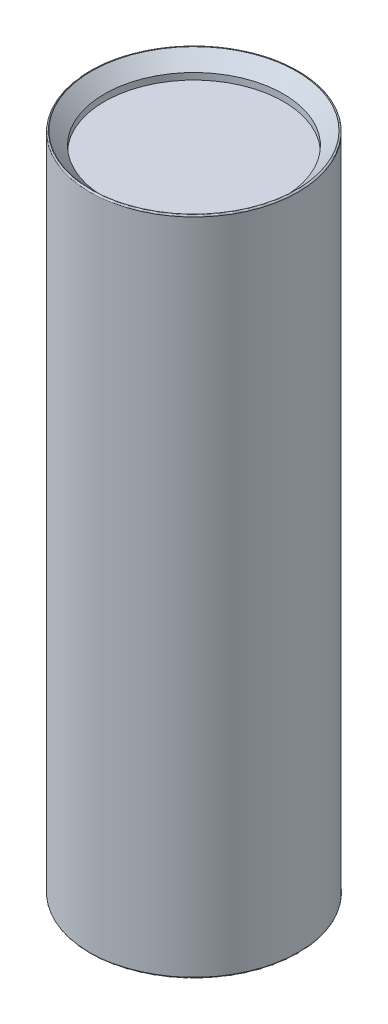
from build123d import *

# Parameters (mm, degrees)
SKETCH1_R                          = 20.193
BOSS_EXTRUDE1_DEPTH                = 128.016
SKETCH2_R                          = 17.328427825
CUT_EXTRUDE1_DEPTH                 = 3.81
CHAMFER1_SIZE                      = 2.54
FILLET1_R                          = 0.254
F_7_16_20_TAPPED_HOLE1_D           = 9.92124
F_7_16_20_TAPPED_HOLE1_DEPTH       = 26.035
F_7_16_20_TAPPED_HOLE1_CBORE_D     = 11.1125
F_7_16_20_TAPPED_HOLE1_CBORE_DEPTH = 22.225
F_7_16_20_TAPPED_HOLE1_TIP         = 2.980641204


with BuildPart() as part:
    # Sketch1 → Boss-Extrude1 (new body)
    with BuildSketch(Plane(origin=(0, 0, 0), x_dir=(1, 0, 0), z_dir=(0, 1, 0))):
        with Locations(Location((0, 0, 0), (0, 0, 270))):
            Circle(SKETCH1_R)
    extrude(amount=BOSS_EXTRUDE1_DEPTH)

    # Sketch2 → Cut-Extrude1 (cut)
    with BuildSketch(Plane(origin=(0, 128.016, 0), x_dir=(1, 0, 0), z_dir=(0, 1, 0))):
        with Locations(Location((0, 0, 0), (0, 0, 270))):
            Circle(SKETCH2_R)
    extrude(amount=-CUT_EXTRUDE1_DEPTH, mode=Mode.SUBTRACT)

    # Chamfer1
    chamfer1_edges = [part.edges().sort_by_distance(p)[0] for p in [
        (0, 128.016, -17.328427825),
    ]]
    chamfer(chamfer1_edges, length=CHAMFER1_SIZE)

    # Fillet1
    fillet1_edges = [part.edges().sort_by_distance(p)[0] for p in [
        (0, 0, -20.193),
        (0, 128.016, -20.193),
    ]]
    fillet(fillet1_edges, radius=FILLET1_R)

    # 7_16-20 Tapped Hole1
    with Locations(Plane.XZ):
        with Locations((0, 0)):
            CounterBoreHole(F_7_16_20_TAPPED_HOLE1_D / 2, F_7_16_20_TAPPED_HOLE1_CBORE_D / 2, F_7_16_20_TAPPED_HOLE1_CBORE_DEPTH, depth=F_7_16_20_TAPPED_HOLE1_DEPTH)
            with Locations((0, 0, -(F_7_16_20_TAPPED_HOLE1_DEPTH + F_7_16_20_TAPPED_HOLE1_TIP / 2))):  # 118° drill point
                Cone(0, F_7_16_20_TAPPED_HOLE1_D / 2, F_7_16_20_TAPPED_HOLE1_TIP, mode=Mode.SUBTRACT)


solid = part.part
